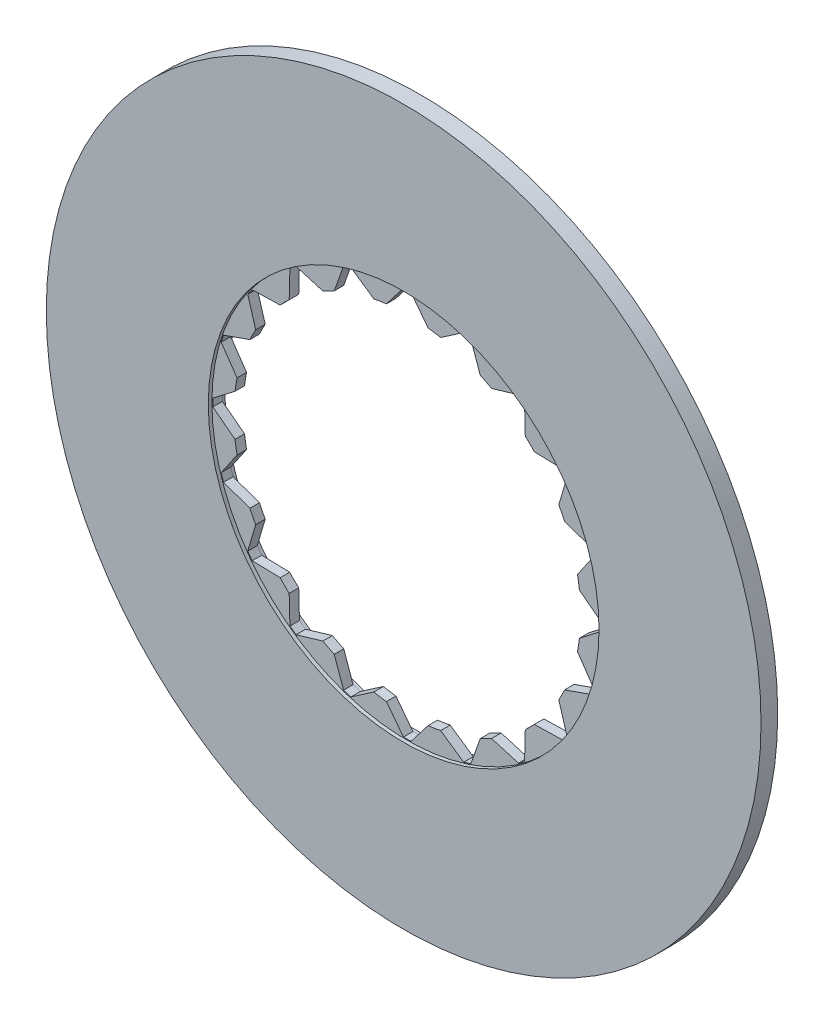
from build123d import *

# Parameters (mm, degrees)
ESQUISSE1_R                  = 37.5
EXTRUSION1_DEPTH             = 0.5
ESQUISSE3_R                  = 18.2
ENL_V_MAT_EXTRU_1_DEPTH      = 10
ENL_V_MAT_EXTRU_2_DEPTH      = 10
R_P_TITION_CIRCULAIRE1_COUNT = 20
ESQUISSE4_R                  = 37.5
ESQUISSE4_R_2                = 20.5
EXTRUSION2_DEPTH             = 0.875


with BuildPart() as part:
    # Esquisse1 → Extrusion1 (new, symmetric)
    with BuildSketch(Plane.XY):
        Circle(ESQUISSE1_R)
    extrude(amount=EXTRUSION1_DEPTH, both=True)

    # Esquisse3 → Enl_v. mat.-Extru.1 (cut)
    with BuildSketch(Plane(origin=(8.969667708, -3.988836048, 0.5), x_dir=(1, 0, 0), z_dir=(0, 0, 1))):
        with Locations((-8.969667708, 3.988836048)):
            Circle(ESQUISSE3_R)
    extrude(amount=-ENL_V_MAT_EXTRU_1_DEPTH, mode=Mode.SUBTRACT)

    # Esquisse2 → Enl_v. mat.-Extru.2 (cut)
    with BuildSketch(Plane(origin=(8.969667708, -3.988836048, 0.5), x_dir=(1, 0, 0), z_dir=(0, 0, 1))):
        with BuildLine():
            Line((-8.571999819, 24.384959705), (-6.785967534, 22.057357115))
            Line((-6.785967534, 22.057357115), (-11.153367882, 22.057357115))
            Line((-11.153367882, 22.057357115), (-9.367335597, 24.384959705))
            ThreePointArc((-9.367335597, 24.384959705), (-8.969667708, 24.388836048), (-8.571999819, 24.384959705))
        make_face()
    enl_v_mat_extru_2 = extrude(amount=-ENL_V_MAT_EXTRU_2_DEPTH, mode=Mode.SUBTRACT)

    # R_p_tition circulaire1: Enl_v. mat.-Extru.2 ×20 about axis
    r_p_tition_circulaire1_axis = Axis((0, 0, 0), (0, 0, 1))
    for i in range(1, R_P_TITION_CIRCULAIRE1_COUNT):
        add(enl_v_mat_extru_2.rotate(r_p_tition_circulaire1_axis, i * 360 / R_P_TITION_CIRCULAIRE1_COUNT), mode=Mode.SUBTRACT)

    # Esquisse4 → Extrusion2 (add, symmetric)
    with BuildSketch(Plane.XY):
        Circle(ESQUISSE4_R)
        Circle(ESQUISSE4_R_2, mode=Mode.SUBTRACT)
    extrude(amount=EXTRUSION2_DEPTH, both=True)


solid = part.part
